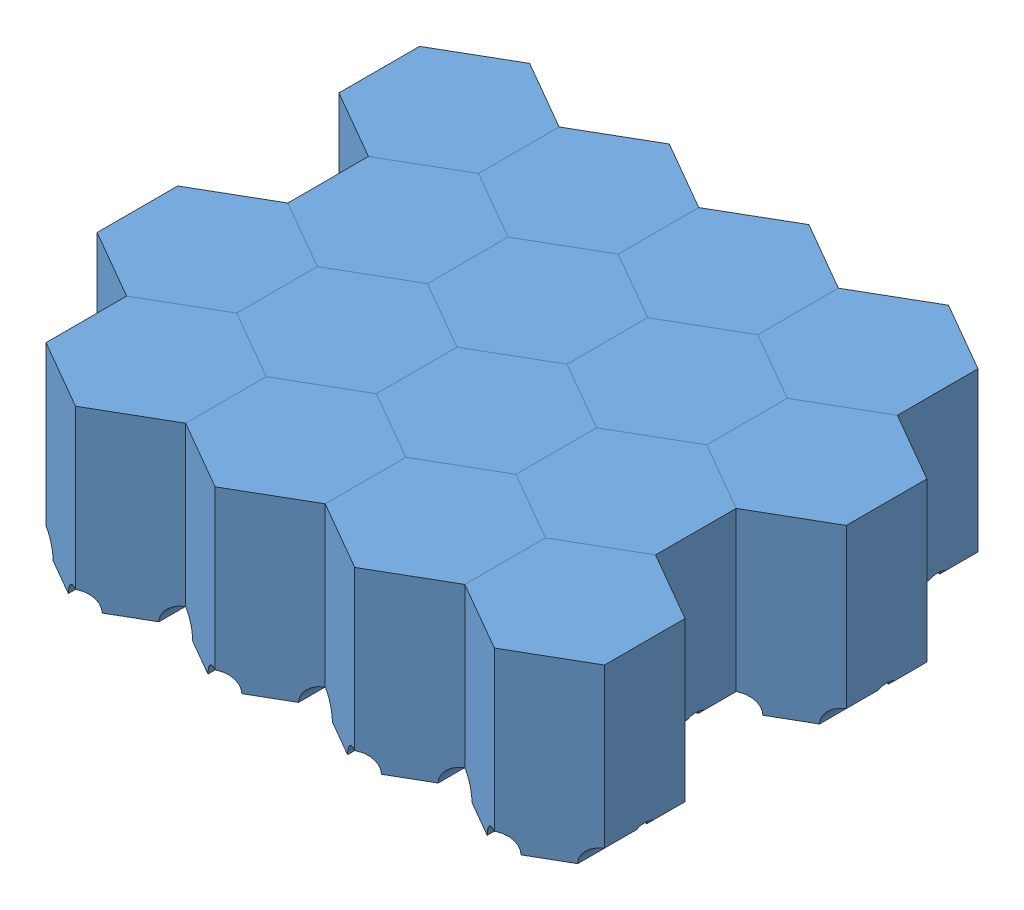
SolidWorks assembly assemblybottom.SLDASM, configuration Default (file format 4700). Lengths in mm.
Overall size (37.88 10.62 31.46).
16 component instances, 1 part files, 2 mates.
Components (placement in the parent):
- majmold3fixed-1: majmold3fixed.SLDPRT [Default] at (-2.6835 -1.0559 2.1334) size (8.54 10.62 9.68)
- majmold3fixed-11: majmold3fixed.SLDPRT [Default] at (-6.8745 -1.0559 -5.1256) size (8.54 10.62 9.68)
- majmold3fixed-107: majmold3fixed.SLDPRT [Default] at (-2.6835 -1.0559 16.6515) size (8.54 10.62 9.68)
- majmold3fixed-108: majmold3fixed.SLDPRT [Default] at (5.6985 -1.0559 2.1334) size (8.54 10.62 9.68)
- majmold3fixed-109: majmold3fixed.SLDPRT [Default] at (5.6985 -1.0559 16.6515) size (8.54 10.62 9.68)
- majmold3fixed-110: majmold3fixed.SLDPRT [Default] at (14.0805 -1.0559 2.1334) size (8.54 10.62 9.68)
- majmold3fixed-111: majmold3fixed.SLDPRT [Default] at (14.0805 -1.0559 16.6515) size (8.54 10.62 9.68)
- majmold3fixed-112: majmold3fixed.SLDPRT [Default] at (22.4625 -1.0559 2.1334) size (8.54 10.62 9.68)
- majmold3fixed-113: majmold3fixed.SLDPRT [Default] at (22.4625 -1.0559 16.6515) size (8.54 10.62 9.68)
- majmold3fixed-114: majmold3fixed.SLDPRT [Default] at (-6.8745 -1.0559 9.3925) size (8.54 10.62 9.68)
- majmold3fixed-115: majmold3fixed.SLDPRT [Default] at (1.5075 -1.0559 -5.1256) size (8.54 10.62 9.68)
- majmold3fixed-116: majmold3fixed.SLDPRT [Default] at (1.5075 -1.0559 9.3925) size (8.54 10.62 9.68)
- majmold3fixed-117: majmold3fixed.SLDPRT [Default] at (9.8895 -1.0559 -5.1256) size (8.54 10.62 9.68)
- majmold3fixed-118: majmold3fixed.SLDPRT [Default] at (9.8895 -1.0559 9.3925) size (8.54 10.62 9.68)
- majmold3fixed-119: majmold3fixed.SLDPRT [Default] at (18.2715 -1.0559 -5.1256) size (8.54 10.62 9.68)
- majmold3fixed-120: majmold3fixed.SLDPRT [Default] at (18.2715 -1.0559 9.3925) size (8.54 10.62 9.68)
Mates (geometry in assembly coordinates):
- Parallel1: parallel aligned: line of majmold3fixed-11 through (-7.8905 -2.7069 -9.3784) axis (-0.866025 0 0.5); line of majmold3fixed-1 through (-3.6995 -2.7069 -2.1193) axis (-0.866025 0 0.5)
- Coincident4: coincident anti-aligned: line of majmold3fixed-1 through (-3.6995 -2.7069 -2.1193) axis (-0.866025 0 0.5); line of majmold3fixed-11 through (-5.8585 -2.7069 -0.8728) axis (0.866025 0 -0.5)
